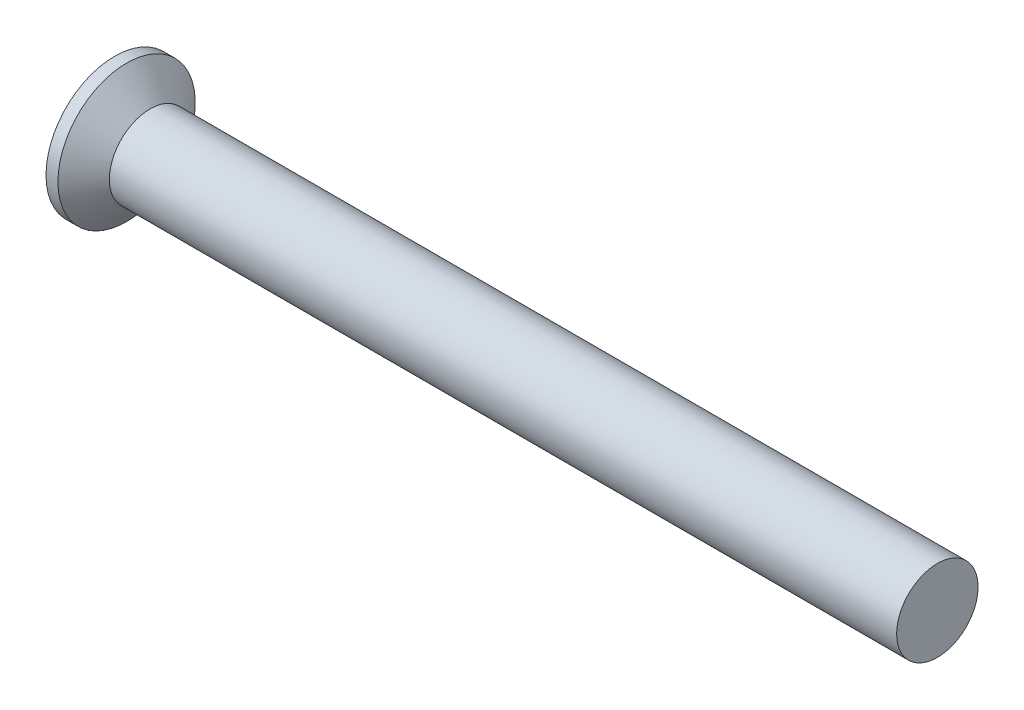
from build123d import *

# Parameters (mm, degrees)
CIRPATTERN1_COUNT = 2
CIRPATTERN1_ANGLE = 90


with BuildPart() as part:
    # BodySke → Base-Revolve (revolve)
    with BuildSketch(Plane.XY, mode=Mode.PRIVATE) as base_revolve_sk:
        Polygon((0, 0), (0, 2.1209), (0.367553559, 2.1209), (1.0922, 1.2573), (25.4, 1.2573), (25.4, 0), align=None)
    revolve(base_revolve_sk.sketch.rotate(Axis((-6.35, 0, 0), (1, 0, 0)), 90), axis=Axis((-6.35, 0, 0), (1, 0, 0)))

    # Sketch3 → Cross section 0
    with BuildSketch(Plane.ZY):
        with BuildLine():
            Line((-0.3429, 1.4986), (0.3429, 1.4986))
            Line((0.3429, 1.4986), (0.3429, -1.4986))
            Line((0.3429, -1.4986), (-0.3429, -1.4986))
            Line((-0.3429, -1.4986), (-0.3429, 1.4986))
        make_face()
    # Sketch4 → Cross section 1
    with BuildSketch(Plane.ZY.offset(-1.9558)):
        with BuildLine():
            Line((-0.17145, 0.17145), (0.17145, 0.17145))
            Line((0.17145, 0.17145), (0.17145, -0.17145))
            Line((0.17145, -0.17145), (-0.17145, -0.17145))
            Line((-0.17145, -0.17145), (-0.17145, 0.17145))
        make_face()
    cross = loft(mode=Mode.SUBTRACT)

    # CirPattern1: Cross ×2 about axis
    cirpattern1_axis = Axis((0, 0, 0), (1, 0, 0))
    for i in range(1, CIRPATTERN1_COUNT):
        add(cross.rotate(cirpattern1_axis, i * CIRPATTERN1_ANGLE / (CIRPATTERN1_COUNT - 1)), mode=Mode.SUBTRACT)


solid = part.part
